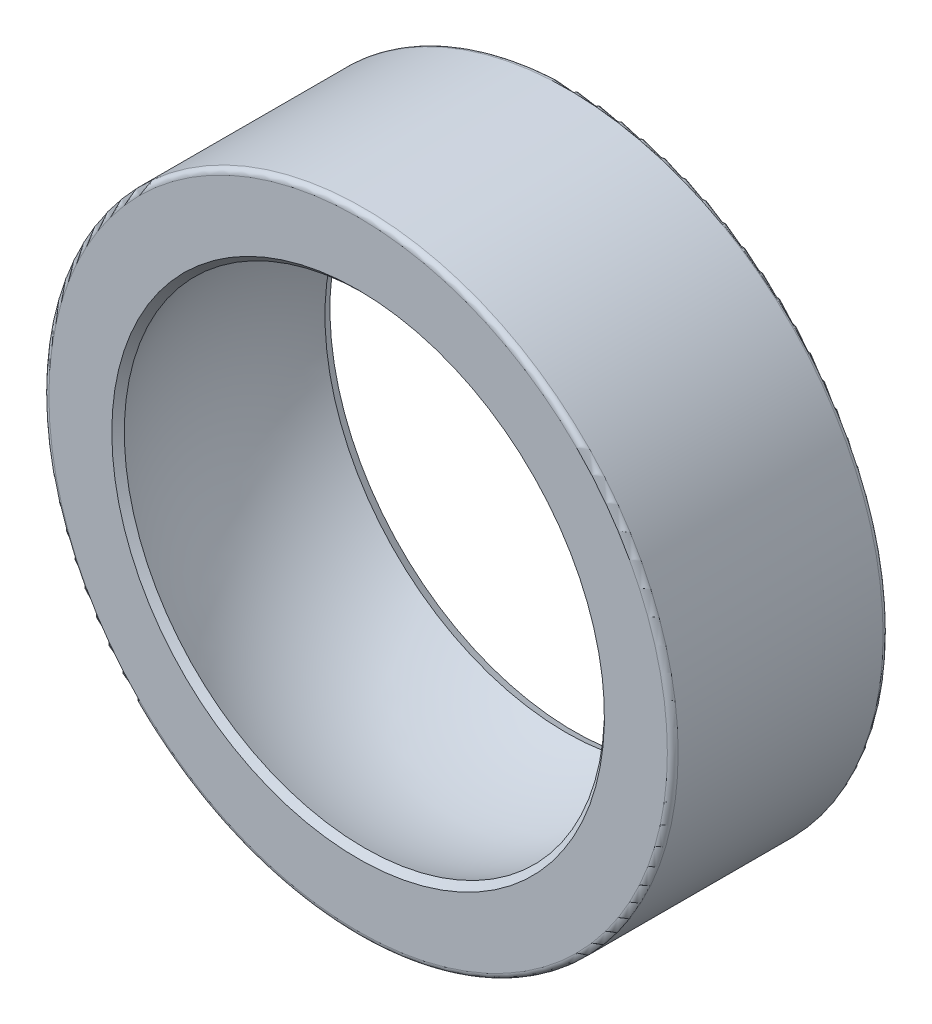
ISO-10303-21;
HEADER;
FILE_DESCRIPTION(('STEP AP214'),'2;1');
FILE_NAME('part.step','',(''),(''),'','','');
FILE_SCHEMA(('AUTOMOTIVE_DESIGN { 1 0 10303 214 1 1 1 1 }'));
ENDSEC;
DATA;
#1=APPLICATION_CONTEXT('core data for automotive mechanical design processes');
#2=APPLICATION_PROTOCOL_DEFINITION('international standard','automotive_design',2000,#1);
#3=PRODUCT_CONTEXT('',#1,'mechanical');
#4=PRODUCT('Part','Part','',(#3));
#5=PRODUCT_RELATED_PRODUCT_CATEGORY('part','',(#4));
#6=PRODUCT_DEFINITION_FORMATION('','',#4);
#7=PRODUCT_DEFINITION_CONTEXT('part definition',#1,'design');
#8=PRODUCT_DEFINITION('design','',#6,#7);
#9=PRODUCT_DEFINITION_SHAPE('','',#8);
#10=(LENGTH_UNIT() NAMED_UNIT(*) SI_UNIT(.MILLI.,.METRE.));
#11=(NAMED_UNIT(*) PLANE_ANGLE_UNIT() SI_UNIT($,.RADIAN.));
#12=(NAMED_UNIT(*) SI_UNIT($,.STERADIAN.) SOLID_ANGLE_UNIT());
#13=UNCERTAINTY_MEASURE_WITH_UNIT(LENGTH_MEASURE(1.E-05),#10,'distance_accuracy_value','');
#14=(GEOMETRIC_REPRESENTATION_CONTEXT(3) GLOBAL_UNCERTAINTY_ASSIGNED_CONTEXT((#13)) GLOBAL_UNIT_ASSIGNED_CONTEXT((#10,
#11,#12)) REPRESENTATION_CONTEXT('',''));
#15=CARTESIAN_POINT('',(0.,0.,0.));
#16=DIRECTION('',(0.,0.,1.));
#17=DIRECTION('',(1.,0.,0.));
#18=AXIS2_PLACEMENT_3D('',#15,#16,#17);
#19=CARTESIAN_POINT('',(0.,17.5000000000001,5.99999999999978));
#20=DIRECTION('',(0.,0.,-1.));
#21=DIRECTION('',(-1.,0.,0.));
#22=AXIS2_PLACEMENT_3D('',#19,#20,#21);
#23=PLANE('',#22);
#24=CARTESIAN_POINT('',(1.33226762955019E-12,0.,6.00000000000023));
#25=DIRECTION('',(0.,0.,-1.));
#26=DIRECTION('',(-1.,0.,0.));
#27=AXIS2_PLACEMENT_3D('',#24,#25,#26);
#28=CIRCLE('',#27,13.7003787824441);
#29=CARTESIAN_POINT('',(-13.7003787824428,0.,6.00000000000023));
#30=VERTEX_POINT('',#29);
#31=EDGE_CURVE('E36',#30,#30,#28,.T.);
#32=ORIENTED_EDGE('',*,*,#31,.T.);
#33=EDGE_LOOP('',(#32));
#34=FACE_BOUND('',#33,.T.);
#35=CARTESIAN_POINT('',(1.33226762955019E-12,0.,6.00000000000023));
#36=DIRECTION('',(0.,0.,-1.));
#37=DIRECTION('',(-1.,0.,0.));
#38=AXIS2_PLACEMENT_3D('',#35,#36,#37);
#39=CIRCLE('',#38,17.2);
#40=CARTESIAN_POINT('',(-17.1999999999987,0.,6.00000000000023));
#41=VERTEX_POINT('',#40);
#42=EDGE_CURVE('E58',#41,#41,#39,.F.);
#43=ORIENTED_EDGE('',*,*,#42,.T.);
#44=EDGE_LOOP('',(#43));
#45=FACE_BOUND('',#44,.T.);
#46=ADVANCED_FACE('F30',(#34,#45),#23,.F.);
#47=CARTESIAN_POINT('',(0.,0.,0.));
#48=DIRECTION('',(0.,0.,1.));
#49=DIRECTION('',(0.,1.,0.));
#50=AXIS2_PLACEMENT_3D('',#47,#48,#49);
#51=SPHERICAL_SURFACE('',#50,14.5);
#52=CARTESIAN_POINT('',(-2.22044604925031E-13,0.,5.65249663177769));
#53=DIRECTION('',(0.,0.,-1.));
#54=DIRECTION('',(-1.,0.,0.));
#55=AXIS2_PLACEMENT_3D('',#52,#53,#54);
#56=CIRCLE('',#55,13.3528754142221);
#57=CARTESIAN_POINT('',(0.,13.3528754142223,5.65249663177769));
#58=VERTEX_POINT('',#57);
#59=EDGE_CURVE('E40',#58,#58,#56,.F.);
#60=CARTESIAN_POINT('',(0.,-3.33066907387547E-13,-5.55062559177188));
#61=DIRECTION('',(0.,0.,1.));
#62=DIRECTION('',(1.,0.,0.));
#63=AXIS2_PLACEMENT_3D('',#60,#61,#62);
#64=CIRCLE('',#63,13.3955423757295);
#65=CARTESIAN_POINT('',(0.,13.3955423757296,-5.55062559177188));
#66=VERTEX_POINT('',#65);
#67=EDGE_CURVE('E44',#66,#66,#64,.F.);
#68=CARTESIAN_POINT('',(0.,13.3528754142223,5.65249663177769));
#69=CARTESIAN_POINT('',(0.,13.399583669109,5.54215870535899));
#70=CARTESIAN_POINT('',(0.,13.4449237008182,5.43124160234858));
#71=CARTESIAN_POINT('',(0.,13.532840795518,5.20831772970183));
#72=CARTESIAN_POINT('',(0.,13.5754178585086,5.09631096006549));
#73=CARTESIAN_POINT('',(0.,13.6577824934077,4.87127644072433));
#74=CARTESIAN_POINT('',(0.,13.6975700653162,4.75824869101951));
#75=CARTESIAN_POINT('',(0.,13.7743313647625,4.53124170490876));
#76=CARTESIAN_POINT('',(0.,13.8113050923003,4.41726246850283));
#77=CARTESIAN_POINT('',(0.,13.8824159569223,4.18842253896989));
#78=CARTESIAN_POINT('',(0.,13.9165530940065,4.07356184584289));
#79=CARTESIAN_POINT('',(0.,13.9819698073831,3.8430295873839));
#80=CARTESIAN_POINT('',(0.,14.0132493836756,3.7273580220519));
#81=CARTESIAN_POINT('',(0.,14.0729317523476,3.49527509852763));
#82=CARTESIAN_POINT('',(0.,14.1013345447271,3.37886374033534));
#83=CARTESIAN_POINT('',(0.,14.155245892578,3.1453727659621));
#84=CARTESIAN_POINT('',(0.,14.1807544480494,3.02829314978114));
#85=CARTESIAN_POINT('',(0.,14.2288616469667,2.79353760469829));
#86=CARTESIAN_POINT('',(0.,14.2514602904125,2.6758616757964));
#87=CARTESIAN_POINT('',(0.,14.2937337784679,2.43998581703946));
#88=CARTESIAN_POINT('',(0.,14.3134086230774,2.32178588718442));
#89=CARTESIAN_POINT('',(0.,14.3498224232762,2.08493466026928));
#90=CARTESIAN_POINT('',(0.,14.3665613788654,1.96628336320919));
#91=CARTESIAN_POINT('',(0.,14.3970931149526,1.72860231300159));
#92=CARTESIAN_POINT('',(0.,14.4108858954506,1.60957255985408));
#93=CARTESIAN_POINT('',(0.,14.4355168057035,1.3712077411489));
#94=CARTESIAN_POINT('',(0.,14.4463549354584,1.25187267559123));
#95=CARTESIAN_POINT('',(0.,14.465069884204,1.01297056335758));
#96=CARTESIAN_POINT('',(0.,14.4729467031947,0.893403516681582));
#97=CARTESIAN_POINT('',(0.,14.4857341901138,0.654110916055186));
#98=CARTESIAN_POINT('',(0.,14.4906448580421,0.534385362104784));
#99=CARTESIAN_POINT('',(0.,14.4974970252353,0.294849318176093));
#100=CARTESIAN_POINT('',(0.,14.4994385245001,0.175038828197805));
#101=CARTESIAN_POINT('',(0.,14.5003511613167,-0.0645934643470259));
#102=CARTESIAN_POINT('',(0.,14.4993222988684,-0.184415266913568));
#103=CARTESIAN_POINT('',(0.,14.4942948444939,-0.423996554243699));
#104=CARTESIAN_POINT('',(0.,14.4902962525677,-0.543756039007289));
#105=CARTESIAN_POINT('',(0.,14.4793317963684,-0.783139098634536));
#106=CARTESIAN_POINT('',(0.,14.4723659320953,-0.902762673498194));
#107=CARTESIAN_POINT('',(0.,14.4554712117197,-1.14180040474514));
#108=CARTESIAN_POINT('',(0.,14.4455423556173,-1.26121456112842));
#109=CARTESIAN_POINT('',(0.,14.4227277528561,-1.49976007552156));
#110=CARTESIAN_POINT('',(0.,14.4098420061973,-1.61889143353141));
#111=CARTESIAN_POINT('',(0.,14.381121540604,-1.8567981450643));
#112=CARTESIAN_POINT('',(0.,14.3652868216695,-1.97557349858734));
#113=CARTESIAN_POINT('',(0.,14.3306781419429,-2.21269521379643));
#114=CARTESIAN_POINT('',(0.,14.3119041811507,-2.33104157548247));
#115=CARTESIAN_POINT('',(0.,14.2714285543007,-2.56723258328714));
#116=CARTESIAN_POINT('',(0.,14.2497268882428,-2.68507722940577));
#117=CARTESIAN_POINT('',(0.,14.2034091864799,-2.92019239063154));
#118=CARTESIAN_POINT('',(0.,14.178793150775,-3.03746290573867));
#119=CARTESIAN_POINT('',(0.,14.1266618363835,-3.27135774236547));
#120=CARTESIAN_POINT('',(0.,14.0991465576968,-3.38798206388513));
#121=CARTESIAN_POINT('',(0.,14.041233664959,-3.62051284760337));
#122=CARTESIAN_POINT('',(0.,14.0108360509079,-3.73641930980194));
#123=CARTESIAN_POINT('',(0.,13.947177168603,-3.96744315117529));
#124=CARTESIAN_POINT('',(0.,13.9139159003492,-4.08256053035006));
#125=CARTESIAN_POINT('',(0.,13.8445501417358,-4.31193546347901));
#126=CARTESIAN_POINT('',(0.,13.8084456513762,-4.4261930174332));
#127=CARTESIAN_POINT('',(0.,13.7334156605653,-4.65377809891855));
#128=CARTESIAN_POINT('',(0.,13.6944901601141,-4.76710562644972));
#129=CARTESIAN_POINT('',(0.,13.6138419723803,-4.99276097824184));
#130=CARTESIAN_POINT('',(0.,13.5721192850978,-5.1050888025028));
#131=CARTESIAN_POINT('',(0.,13.4859027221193,-5.32867586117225));
#132=CARTESIAN_POINT('',(0.,13.4414088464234,-5.43993509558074));
#133=CARTESIAN_POINT('',(0.,13.3955423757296,-5.55062559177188));
#134=B_SPLINE_CURVE_WITH_KNOTS('',3,(#68,#69,#70,#71,#72,#73,#74,#75,#76,#77,#78,#79,#80,#81,
#82,#83,#84,#85,#86,#87,#88,#89,#90,#91,#92,#93,#94,#95,#96,#97,#98,#99,#100,#101,#102,#103,
#104,#105,#106,#107,#108,#109,#110,#111,#112,#113,#114,#115,#116,#117,#118,#119,#120,#121,#122,
#123,#124,#125,#126,#127,#128,#129,#130,#131,#132,#133),.UNSPECIFIED.,.F.,.F.,(4,2,2,2,2,2,2,2,
2,2,2,2,2,2,2,2,2,2,2,2,2,2,2,2,2,2,2,2,2,2,2,2,4),(0.,0.359441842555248,0.718883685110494,
1.07832552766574,1.43776737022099,1.79720921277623,2.15665105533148,2.51609289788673,
2.87553474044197,3.23497658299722,3.59441842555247,3.95386026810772,4.31330211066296,
4.67274395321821,5.03218579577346,5.3916276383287,5.75106948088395,6.1105113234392,
6.46995316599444,6.82939500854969,7.18883685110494,7.54827869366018,7.90772053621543,
8.26716237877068,8.62660422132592,8.98604606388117,9.34548790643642,9.70492974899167,
10.0643715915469,10.4238134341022,10.7832552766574,11.1426971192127,11.5021389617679),.UNSPECIFIED.);
#135=EDGE_CURVE('BSEAM81',#58,#66,#134,.T.);
#136=ORIENTED_EDGE('',*,*,#59,.T.);
#137=ORIENTED_EDGE('',*,*,#67,.T.);
#138=ORIENTED_EDGE('',*,*,#135,.T.);
#139=ORIENTED_EDGE('',*,*,#135,.F.);
#140=EDGE_LOOP('',(#136,#138,#137,#139));
#141=FACE_BOUND('',#140,.T.);
#142=ADVANCED_FACE('F81',(#141),#51,.F.);
#143=CARTESIAN_POINT('',(-4.44089209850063E-13,17.4999999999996,-5.99999999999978));
#144=DIRECTION('',(0.,0.,1.));
#145=DIRECTION('',(1.,0.,0.));
#146=AXIS2_PLACEMENT_3D('',#143,#144,#145);
#147=PLANE('',#146);
#148=CARTESIAN_POINT('',(-2.22044604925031E-13,-3.33066907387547E-13,-6.00000000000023));
#149=DIRECTION('',(0.,0.,1.));
#150=DIRECTION('',(1.,0.,0.));
#151=AXIS2_PLACEMENT_3D('',#148,#149,#150);
#152=CIRCLE('',#151,13.5687662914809);
#153=CARTESIAN_POINT('',(13.5687662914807,-3.33066907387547E-13,-6.00000000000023));
#154=VERTEX_POINT('',#153);
#155=EDGE_CURVE('E10',#154,#154,#152,.T.);
#156=ORIENTED_EDGE('',*,*,#155,.T.);
#157=EDGE_LOOP('',(#156));
#158=FACE_BOUND('',#157,.T.);
#159=CARTESIAN_POINT('',(-2.22044604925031E-13,-3.33066907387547E-13,-6.00000000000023));
#160=DIRECTION('',(0.,0.,1.));
#161=DIRECTION('',(1.,0.,0.));
#162=AXIS2_PLACEMENT_3D('',#159,#160,#161);
#163=CIRCLE('',#162,17.2);
#164=CARTESIAN_POINT('',(17.1999999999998,-3.33066907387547E-13,-6.00000000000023));
#165=VERTEX_POINT('',#164);
#166=EDGE_CURVE('E49',#165,#165,#163,.F.);
#167=ORIENTED_EDGE('',*,*,#166,.T.);
#168=EDGE_LOOP('',(#167));
#169=FACE_BOUND('',#168,.T.);
#170=ADVANCED_FACE('F76',(#158,#169),#147,.F.);
#171=CARTESIAN_POINT('',(0.,1.11022302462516E-13,24.6973009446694));
#172=DIRECTION('',(0.,0.,1.));
#173=DIRECTION('',(1.,0.,0.));
#174=AXIS2_PLACEMENT_3D('',#171,#172,#173);
#175=CYLINDRICAL_SURFACE('',#174,17.5);
#176=CARTESIAN_POINT('',(-4.44089209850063E-13,0.,5.70000000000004));
#177=DIRECTION('',(0.,0.,-1.));
#178=DIRECTION('',(-1.,0.,0.));
#179=AXIS2_PLACEMENT_3D('',#176,#177,#178);
#180=CIRCLE('',#179,17.5);
#181=CARTESIAN_POINT('',(-17.5000000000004,0.,5.70000000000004));
#182=VERTEX_POINT('',#181);
#183=EDGE_CURVE('E52',#182,#182,#180,.T.);
#184=ORIENTED_EDGE('',*,*,#183,.T.);
#185=EDGE_LOOP('',(#184));
#186=FACE_BOUND('',#185,.T.);
#187=CARTESIAN_POINT('',(-2.22044604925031E-13,-3.33066907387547E-13,-5.70000000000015));
#188=DIRECTION('',(0.,0.,1.));
#189=DIRECTION('',(1.,0.,0.));
#190=AXIS2_PLACEMENT_3D('',#187,#188,#189);
#191=CIRCLE('',#190,17.5);
#192=CARTESIAN_POINT('',(17.4999999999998,-3.33066907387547E-13,-5.70000000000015));
#193=VERTEX_POINT('',#192);
#194=EDGE_CURVE('E55',#193,#193,#191,.T.);
#195=ORIENTED_EDGE('',*,*,#194,.T.);
#196=EDGE_LOOP('',(#195));
#197=FACE_BOUND('',#196,.T.);
#198=ADVANCED_FACE('F66',(#186,#197),#175,.T.);
#199=CARTESIAN_POINT('',(-4.44089209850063E-13,0.,5.70000000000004));
#200=DIRECTION('',(0.,0.,-1.));
#201=DIRECTION('',(-1.,0.,0.));
#202=AXIS2_PLACEMENT_3D('',#199,#200,#201);
#203=TOROIDAL_SURFACE('',#202,17.2,0.3);
#204=ORIENTED_EDGE('',*,*,#183,.F.);
#205=EDGE_LOOP('',(#204));
#206=FACE_BOUND('',#205,.T.);
#207=ORIENTED_EDGE('',*,*,#42,.F.);
#208=EDGE_LOOP('',(#207));
#209=FACE_BOUND('',#208,.T.);
#210=ADVANCED_FACE('F63',(#206,#209),#203,.T.);
#211=CARTESIAN_POINT('',(-2.22044604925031E-13,-3.33066907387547E-13,-5.70000000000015));
#212=DIRECTION('',(0.,0.,1.));
#213=DIRECTION('',(1.,0.,0.));
#214=AXIS2_PLACEMENT_3D('',#211,#212,#213);
#215=TOROIDAL_SURFACE('',#214,17.2,0.3);
#216=ORIENTED_EDGE('',*,*,#166,.F.);
#217=EDGE_LOOP('',(#216));
#218=FACE_BOUND('',#217,.T.);
#219=ORIENTED_EDGE('',*,*,#194,.F.);
#220=EDGE_LOOP('',(#219));
#221=FACE_BOUND('',#220,.T.);
#222=ADVANCED_FACE('F65',(#218,#221),#215,.T.);
#223=CARTESIAN_POINT('',(-2.22044604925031E-13,0.,5.65249663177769));
#224=DIRECTION('',(0.,0.,1.));
#225=DIRECTION('',(1.,0.,0.));
#226=AXIS2_PLACEMENT_3D('',#223,#224,#225);
#227=CONICAL_SURFACE('',#226,13.3528754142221,0.785398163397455);
#228=ORIENTED_EDGE('',*,*,#31,.F.);
#229=EDGE_LOOP('',(#228));
#230=FACE_BOUND('',#229,.T.);
#231=ORIENTED_EDGE('',*,*,#59,.F.);
#232=EDGE_LOOP('',(#231));
#233=FACE_BOUND('',#232,.T.);
#234=ADVANCED_FACE('F73',(#230,#233),#227,.F.);
#235=CARTESIAN_POINT('',(-2.22044604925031E-13,-3.33066907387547E-13,-6.00000000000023));
#236=DIRECTION('',(0.,0.,-1.));
#237=DIRECTION('',(-1.,0.,0.));
#238=AXIS2_PLACEMENT_3D('',#235,#236,#237);
#239=CONICAL_SURFACE('',#238,13.5687662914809,0.367925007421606);
#240=ORIENTED_EDGE('',*,*,#67,.F.);
#241=EDGE_LOOP('',(#240));
#242=FACE_BOUND('',#241,.T.);
#243=ORIENTED_EDGE('',*,*,#155,.F.);
#244=EDGE_LOOP('',(#243));
#245=FACE_BOUND('',#244,.T.);
#246=ADVANCED_FACE('F94',(#242,#245),#239,.F.);
#247=CLOSED_SHELL('',(#46,#142,#170,#198,#210,#222,#234,#246));
#248=MANIFOLD_SOLID_BREP('B2',#247);
#249=ADVANCED_BREP_SHAPE_REPRESENTATION('',(#18,#248),#14);
#250=SHAPE_DEFINITION_REPRESENTATION(#9,#249);
ENDSEC;
END-ISO-10303-21;
